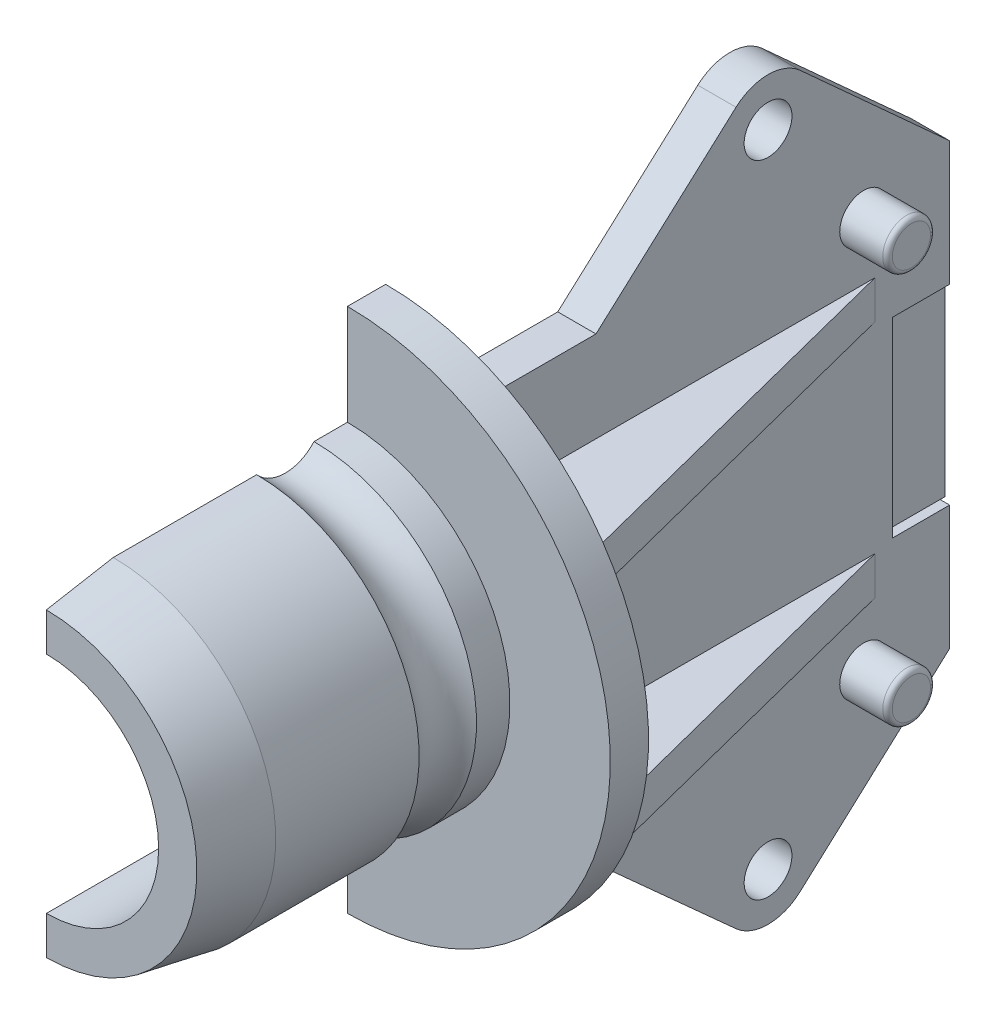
ISO-10303-21;
HEADER;
FILE_DESCRIPTION(('STEP AP214'),'2;1');
FILE_NAME('part.step','',(''),(''),'','','');
FILE_SCHEMA(('AUTOMOTIVE_DESIGN { 1 0 10303 214 1 1 1 1 }'));
ENDSEC;
DATA;
#1=APPLICATION_CONTEXT('core data for automotive mechanical design processes');
#2=APPLICATION_PROTOCOL_DEFINITION('international standard','automotive_design',2000,#1);
#3=PRODUCT_CONTEXT('',#1,'mechanical');
#4=PRODUCT('Part','Part','',(#3));
#5=PRODUCT_RELATED_PRODUCT_CATEGORY('part','',(#4));
#6=PRODUCT_DEFINITION_FORMATION('','',#4);
#7=PRODUCT_DEFINITION_CONTEXT('part definition',#1,'design');
#8=PRODUCT_DEFINITION('design','',#6,#7);
#9=PRODUCT_DEFINITION_SHAPE('','',#8);
#10=(LENGTH_UNIT() NAMED_UNIT(*) SI_UNIT(.MILLI.,.METRE.));
#11=(NAMED_UNIT(*) PLANE_ANGLE_UNIT() SI_UNIT($,.RADIAN.));
#12=(NAMED_UNIT(*) SI_UNIT($,.STERADIAN.) SOLID_ANGLE_UNIT());
#13=UNCERTAINTY_MEASURE_WITH_UNIT(LENGTH_MEASURE(1.E-05),#10,'distance_accuracy_value','');
#14=(GEOMETRIC_REPRESENTATION_CONTEXT(3) GLOBAL_UNCERTAINTY_ASSIGNED_CONTEXT((#13)) GLOBAL_UNIT_ASSIGNED_CONTEXT((#10,
#11,#12)) REPRESENTATION_CONTEXT('',''));
#15=CARTESIAN_POINT('',(0.,0.,0.));
#16=DIRECTION('',(0.,0.,1.));
#17=DIRECTION('',(1.,0.,0.));
#18=AXIS2_PLACEMENT_3D('',#15,#16,#17);
#19=CARTESIAN_POINT('',(24.,-67.,-127.));
#20=DIRECTION('',(1.,0.,0.));
#21=DIRECTION('',(0.,0.,-1.));
#22=AXIS2_PLACEMENT_3D('',#19,#20,#21);
#23=PLANE('',#22);
#24=CARTESIAN_POINT('',(24.,-41.,-147.));
#25=DIRECTION('',(1.,0.,0.));
#26=DIRECTION('',(0.,0.,-1.));
#27=AXIS2_PLACEMENT_3D('',#24,#25,#26);
#28=CIRCLE('',#27,5.00000000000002);
#29=CARTESIAN_POINT('',(24.,-41.,-152.));
#30=VERTEX_POINT('',#29);
#31=EDGE_CURVE('E586',#30,#30,#28,.T.);
#32=ORIENTED_EDGE('',*,*,#31,.F.);
#33=EDGE_LOOP('',(#32));
#34=FACE_BOUND('',#33,.T.);
#35=CARTESIAN_POINT('',(24.,67.,-127.));
#36=DIRECTION('',(1.,0.,0.));
#37=DIRECTION('',(0.,0.,-1.));
#38=AXIS2_PLACEMENT_3D('',#35,#36,#37);
#39=CIRCLE('',#38,5.00000000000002);
#40=CARTESIAN_POINT('',(24.,67.,-132.));
#41=VERTEX_POINT('',#40);
#42=EDGE_CURVE('E574',#41,#41,#39,.T.);
#43=ORIENTED_EDGE('',*,*,#42,.F.);
#44=EDGE_LOOP('',(#43));
#45=FACE_BOUND('',#44,.T.);
#46=CARTESIAN_POINT('',(24.,-67.,-127.));
#47=DIRECTION('',(1.,0.,0.));
#48=DIRECTION('',(0.,0.,1.));
#49=AXIS2_PLACEMENT_3D('',#46,#47,#48);
#50=CIRCLE('',#49,5.00000000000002);
#51=CARTESIAN_POINT('',(24.,-67.,-122.));
#52=VERTEX_POINT('',#51);
#53=EDGE_CURVE('E580',#52,#52,#50,.T.);
#54=ORIENTED_EDGE('',*,*,#53,.F.);
#55=EDGE_LOOP('',(#54));
#56=FACE_BOUND('',#55,.T.);
#57=DIRECTION('',(0.,0.,-1.));
#58=VECTOR('',#57,1.);
#59=CARTESIAN_POINT('',(24.,-20.,-153.));
#60=LINE('',#59,#58);
#61=CARTESIAN_POINT('',(24.,-20.,-153.));
#62=VERTEX_POINT('',#61);
#63=CARTESIAN_POINT('',(24.,-20.,-165.));
#64=VERTEX_POINT('',#63);
#65=EDGE_CURVE('E645',#62,#64,#60,.T.);
#66=ORIENTED_EDGE('',*,*,#65,.F.);
#67=DIRECTION('',(0.,-1.,0.));
#68=VECTOR('',#67,1.);
#69=CARTESIAN_POINT('',(24.,-20.,-153.));
#70=LINE('',#69,#68);
#71=CARTESIAN_POINT('',(24.,20.,-153.));
#72=VERTEX_POINT('',#71);
#73=EDGE_CURVE('E650',#72,#62,#70,.T.);
#74=ORIENTED_EDGE('',*,*,#73,.F.);
#75=DIRECTION('',(0.,0.,-1.));
#76=VECTOR('',#75,1.);
#77=CARTESIAN_POINT('',(24.,20.,-153.));
#78=LINE('',#77,#76);
#79=CARTESIAN_POINT('',(24.,20.,-165.));
#80=VERTEX_POINT('',#79);
#81=EDGE_CURVE('E642',#72,#80,#78,.T.);
#82=ORIENTED_EDGE('',*,*,#81,.T.);
#83=DIRECTION('',(0.,1.,0.));
#84=VECTOR('',#83,1.);
#85=CARTESIAN_POINT('',(24.,-46.,-165.));
#86=LINE('',#85,#84);
#87=CARTESIAN_POINT('',(24.,46.,-165.));
#88=VERTEX_POINT('',#87);
#89=EDGE_CURVE('E536',#80,#88,#86,.T.);
#90=ORIENTED_EDGE('',*,*,#89,.T.);
#91=DIRECTION('',(0.,0.672272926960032,0.740303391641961));
#92=VECTOR('',#91,1.);
#93=CARTESIAN_POINT('',(24.,74.4030339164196,-133.7227292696));
#94=LINE('',#93,#92);
#95=CARTESIAN_POINT('',(24.,74.4030339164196,-133.7227292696));
#96=VERTEX_POINT('',#95);
#97=EDGE_CURVE('E531',#88,#96,#94,.T.);
#98=ORIENTED_EDGE('',*,*,#97,.T.);
#99=CARTESIAN_POINT('',(24.,67.,-127.));
#100=DIRECTION('',(1.,0.,0.));
#101=DIRECTION('',(0.,0.,1.));
#102=AXIS2_PLACEMENT_3D('',#99,#100,#101);
#103=CIRCLE('',#102,10.);
#104=CARTESIAN_POINT('',(24.,74.426181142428,-120.302848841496));
#105=VERTEX_POINT('',#104);
#106=EDGE_CURVE('E529',#96,#105,#103,.T.);
#107=ORIENTED_EDGE('',*,*,#106,.T.);
#108=DIRECTION('',(0.,-0.669715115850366,0.742618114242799));
#109=VECTOR('',#108,1.);
#110=CARTESIAN_POINT('',(24.,48.,-91.));
#111=LINE('',#110,#109);
#112=CARTESIAN_POINT('',(24.,48.,-91.));
#113=VERTEX_POINT('',#112);
#114=EDGE_CURVE('E527',#105,#113,#111,.T.);
#115=ORIENTED_EDGE('',*,*,#114,.T.);
#116=DIRECTION('',(0.,0.,1.));
#117=VECTOR('',#116,1.);
#118=CARTESIAN_POINT('',(24.,48.,-71.));
#119=LINE('',#118,#117);
#120=CARTESIAN_POINT('',(24.,48.,-71.));
#121=VERTEX_POINT('',#120);
#122=EDGE_CURVE('E524',#113,#121,#119,.T.);
#123=ORIENTED_EDGE('',*,*,#122,.T.);
#124=DIRECTION('',(0.,-1.,0.));
#125=VECTOR('',#124,1.);
#126=CARTESIAN_POINT('',(24.,48.,-71.));
#127=LINE('',#126,#125);
#128=CARTESIAN_POINT('',(24.,29.,-71.));
#129=VERTEX_POINT('',#128);
#130=EDGE_CURVE('E545',#121,#129,#127,.T.);
#131=ORIENTED_EDGE('',*,*,#130,.T.);
#132=DIRECTION('',(0.,0.,1.));
#133=VECTOR('',#132,1.);
#134=CARTESIAN_POINT('',(24.,29.,-71.));
#135=LINE('',#134,#133);
#136=CARTESIAN_POINT('',(24.,29.,-149.3613646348));
#137=VERTEX_POINT('',#136);
#138=EDGE_CURVE('E594',#137,#129,#135,.T.);
#139=ORIENTED_EDGE('',*,*,#138,.F.);
#140=DIRECTION('',(0.,-1.,0.));
#141=VECTOR('',#140,1.);
#142=CARTESIAN_POINT('',(24.,29.,-149.3613646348));
#143=LINE('',#142,#141);
#144=CARTESIAN_POINT('',(24.,21.,-149.3613646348));
#145=VERTEX_POINT('',#144);
#146=EDGE_CURVE('E592',#137,#145,#143,.T.);
#147=ORIENTED_EDGE('',*,*,#146,.T.);
#148=DIRECTION('',(0.,0.,1.));
#149=VECTOR('',#148,1.);
#150=CARTESIAN_POINT('',(24.,21.,-71.));
#151=LINE('',#150,#149);
#152=CARTESIAN_POINT('',(24.,21.,-71.));
#153=VERTEX_POINT('',#152);
#154=EDGE_CURVE('E603',#145,#153,#151,.T.);
#155=ORIENTED_EDGE('',*,*,#154,.T.);
#156=CARTESIAN_POINT('',(24.,-21.,-71.));
#157=VERTEX_POINT('',#156);
#158=EDGE_CURVE('E548',#153,#157,#127,.T.);
#159=ORIENTED_EDGE('',*,*,#158,.T.);
#160=DIRECTION('',(0.,0.,1.));
#161=VECTOR('',#160,1.);
#162=CARTESIAN_POINT('',(24.,-21.,-71.));
#163=LINE('',#162,#161);
#164=CARTESIAN_POINT('',(24.,-21.,-149.3613646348));
#165=VERTEX_POINT('',#164);
#166=EDGE_CURVE('E625',#165,#157,#163,.T.);
#167=ORIENTED_EDGE('',*,*,#166,.F.);
#168=DIRECTION('',(0.,1.,0.));
#169=VECTOR('',#168,1.);
#170=CARTESIAN_POINT('',(24.,-29.,-149.3613646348));
#171=LINE('',#170,#169);
#172=CARTESIAN_POINT('',(24.,-29.,-149.3613646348));
#173=VERTEX_POINT('',#172);
#174=EDGE_CURVE('E610',#173,#165,#171,.T.);
#175=ORIENTED_EDGE('',*,*,#174,.F.);
#176=DIRECTION('',(0.,0.,1.));
#177=VECTOR('',#176,1.);
#178=CARTESIAN_POINT('',(24.,-29.,-71.));
#179=LINE('',#178,#177);
#180=CARTESIAN_POINT('',(24.,-29.,-71.));
#181=VERTEX_POINT('',#180);
#182=EDGE_CURVE('E618',#173,#181,#179,.T.);
#183=ORIENTED_EDGE('',*,*,#182,.T.);
#184=CARTESIAN_POINT('',(24.,-48.,-71.));
#185=VERTEX_POINT('',#184);
#186=EDGE_CURVE('E549',#181,#185,#127,.T.);
#187=ORIENTED_EDGE('',*,*,#186,.T.);
#188=DIRECTION('',(0.,0.,-1.));
#189=VECTOR('',#188,1.);
#190=CARTESIAN_POINT('',(24.,-48.,-71.));
#191=LINE('',#190,#189);
#192=CARTESIAN_POINT('',(24.,-48.,-91.));
#193=VERTEX_POINT('',#192);
#194=EDGE_CURVE('E543',#185,#193,#191,.T.);
#195=ORIENTED_EDGE('',*,*,#194,.T.);
#196=DIRECTION('',(0.,-0.669715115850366,-0.742618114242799));
#197=VECTOR('',#196,1.);
#198=CARTESIAN_POINT('',(24.,-48.,-91.));
#199=LINE('',#198,#197);
#200=CARTESIAN_POINT('',(24.,-74.426181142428,-120.302848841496));
#201=VERTEX_POINT('',#200);
#202=EDGE_CURVE('E541',#193,#201,#199,.T.);
#203=ORIENTED_EDGE('',*,*,#202,.T.);
#204=CARTESIAN_POINT('',(24.,-67.,-127.));
#205=DIRECTION('',(1.,0.,0.));
#206=DIRECTION('',(0.,0.,-1.));
#207=AXIS2_PLACEMENT_3D('',#204,#205,#206);
#208=CIRCLE('',#207,10.);
#209=CARTESIAN_POINT('',(24.,-74.4030339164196,-133.7227292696));
#210=VERTEX_POINT('',#209);
#211=EDGE_CURVE('E539',#201,#210,#208,.T.);
#212=ORIENTED_EDGE('',*,*,#211,.T.);
#213=DIRECTION('',(0.,0.672272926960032,-0.740303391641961));
#214=VECTOR('',#213,1.);
#215=CARTESIAN_POINT('',(24.,-74.4030339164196,-133.7227292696));
#216=LINE('',#215,#214);
#217=CARTESIAN_POINT('',(24.,-46.,-165.));
#218=VERTEX_POINT('',#217);
#219=EDGE_CURVE('E537',#210,#218,#216,.T.);
#220=ORIENTED_EDGE('',*,*,#219,.T.);
#221=EDGE_CURVE('E533',#218,#64,#86,.T.);
#222=ORIENTED_EDGE('',*,*,#221,.T.);
#223=EDGE_LOOP('',(#66,#74,#82,#90,#98,#107,#115,#123,#131,#139,#147,#155,#159,#167,#175,#183,
#187,#195,#203,#212,#220,#222));
#224=FACE_BOUND('',#223,.T.);
#225=CARTESIAN_POINT('',(24.,41.,-147.));
#226=DIRECTION('',(1.,0.,0.));
#227=DIRECTION('',(0.,0.,-1.));
#228=AXIS2_PLACEMENT_3D('',#225,#226,#227);
#229=CIRCLE('',#228,5.00000000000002);
#230=CARTESIAN_POINT('',(24.,41.,-152.));
#231=VERTEX_POINT('',#230);
#232=EDGE_CURVE('E313',#231,#231,#229,.F.);
#233=ORIENTED_EDGE('',*,*,#232,.T.);
#234=EDGE_LOOP('',(#233));
#235=FACE_BOUND('',#234,.T.);
#236=ADVANCED_FACE('F35',(#34,#45,#56,#224,#235),#23,.T.);
#237=CARTESIAN_POINT('',(0.,93.,313.849585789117));
#238=DIRECTION('',(1.,0.,0.));
#239=DIRECTION('',(0.,0.,-1.));
#240=AXIS2_PLACEMENT_3D('',#237,#238,#239);
#241=PLANE('',#240);
#242=DIRECTION('',(0.,-0.175790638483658,0.984427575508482));
#243=VECTOR('',#242,1.);
#244=CARTESIAN_POINT('',(0.,0.,176.4));
#245=LINE('',#244,#243);
#246=CARTESIAN_POINT('',(0.,34.,-14.));
#247=VERTEX_POINT('',#246);
#248=CARTESIAN_POINT('',(0.,31.5,0.));
#249=VERTEX_POINT('',#248);
#250=EDGE_CURVE('E457',#247,#249,#245,.T.);
#251=ORIENTED_EDGE('',*,*,#250,.F.);
#252=DIRECTION('',(0.,0.,1.));
#253=VECTOR('',#252,1.);
#254=CARTESIAN_POINT('',(0.,34.,54.));
#255=LINE('',#254,#253);
#256=CARTESIAN_POINT('',(0.,34.,-44.));
#257=VERTEX_POINT('',#256);
#258=EDGE_CURVE('E678',#257,#247,#255,.T.);
#259=ORIENTED_EDGE('',*,*,#258,.F.);
#260=CARTESIAN_POINT('',(0.,39.2915026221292,-50.));
#261=DIRECTION('',(1.,0.,0.));
#262=DIRECTION('',(0.,0.,-1.));
#263=AXIS2_PLACEMENT_3D('',#260,#261,#262);
#264=CIRCLE('',#263,8.);
#265=CARTESIAN_POINT('',(0.,34.,-56.));
#266=VERTEX_POINT('',#265);
#267=EDGE_CURVE('E681',#266,#257,#264,.F.);
#268=ORIENTED_EDGE('',*,*,#267,.F.);
#269=DIRECTION('',(0.,0.,1.));
#270=VECTOR('',#269,1.);
#271=CARTESIAN_POINT('',(0.,34.,54.));
#272=LINE('',#271,#270);
#273=CARTESIAN_POINT('',(0.,34.,-63.));
#274=VERTEX_POINT('',#273);
#275=EDGE_CURVE('E684',#274,#266,#272,.T.);
#276=ORIENTED_EDGE('',*,*,#275,.F.);
#277=DIRECTION('',(0.,-1.,0.));
#278=VECTOR('',#277,1.);
#279=CARTESIAN_POINT('',(0.,55.,-63.));
#280=LINE('',#279,#278);
#281=CARTESIAN_POINT('',(0.,55.,-63.));
#282=VERTEX_POINT('',#281);
#283=EDGE_CURVE('E687',#282,#274,#280,.T.);
#284=ORIENTED_EDGE('',*,*,#283,.F.);
#285=DIRECTION('',(0.,0.,1.));
#286=VECTOR('',#285,1.);
#287=CARTESIAN_POINT('',(0.,55.,54.));
#288=LINE('',#287,#286);
#289=CARTESIAN_POINT('',(0.,55.,-71.));
#290=VERTEX_POINT('',#289);
#291=EDGE_CURVE('E688',#290,#282,#288,.T.);
#292=ORIENTED_EDGE('',*,*,#291,.F.);
#293=DIRECTION('',(0.,1.,0.));
#294=VECTOR('',#293,1.);
#295=CARTESIAN_POINT('',(0.,15.,-71.));
#296=LINE('',#295,#294);
#297=CARTESIAN_POINT('',(0.,15.,-71.));
#298=VERTEX_POINT('',#297);
#299=EDGE_CURVE('E691',#298,#290,#296,.T.);
#300=ORIENTED_EDGE('',*,*,#299,.F.);
#301=DIRECTION('',(0.,0.,1.));
#302=VECTOR('',#301,1.);
#303=CARTESIAN_POINT('',(0.,15.,54.));
#304=LINE('',#303,#302);
#305=CARTESIAN_POINT('',(0.,15.,-63.));
#306=VERTEX_POINT('',#305);
#307=EDGE_CURVE('E692',#306,#298,#304,.F.);
#308=ORIENTED_EDGE('',*,*,#307,.F.);
#309=DIRECTION('',(0.,-1.,0.));
#310=VECTOR('',#309,1.);
#311=CARTESIAN_POINT('',(0.,22.,-63.));
#312=LINE('',#311,#310);
#313=CARTESIAN_POINT('',(0.,22.,-63.));
#314=VERTEX_POINT('',#313);
#315=EDGE_CURVE('E696',#314,#306,#312,.T.);
#316=ORIENTED_EDGE('',*,*,#315,.F.);
#317=DIRECTION('',(0.,0.,1.));
#318=VECTOR('',#317,1.);
#319=CARTESIAN_POINT('',(0.,22.,54.));
#320=LINE('',#319,#318);
#321=CARTESIAN_POINT('',(0.,22.,-46.));
#322=VERTEX_POINT('',#321);
#323=EDGE_CURVE('E697',#322,#314,#320,.F.);
#324=ORIENTED_EDGE('',*,*,#323,.F.);
#325=DIRECTION('',(0.,-1.,0.));
#326=VECTOR('',#325,1.);
#327=CARTESIAN_POINT('',(0.,23.5,-46.));
#328=LINE('',#327,#326);
#329=CARTESIAN_POINT('',(0.,23.5,-46.));
#330=VERTEX_POINT('',#329);
#331=EDGE_CURVE('E58',#330,#322,#328,.T.);
#332=ORIENTED_EDGE('',*,*,#331,.F.);
#333=DIRECTION('',(0.,0.,1.));
#334=VECTOR('',#333,1.);
#335=CARTESIAN_POINT('',(0.,23.5,54.));
#336=LINE('',#335,#334);
#337=CARTESIAN_POINT('',(0.,23.5,0.));
#338=VERTEX_POINT('',#337);
#339=EDGE_CURVE('E700',#338,#330,#336,.F.);
#340=ORIENTED_EDGE('',*,*,#339,.F.);
#341=DIRECTION('',(0.,-1.,0.));
#342=VECTOR('',#341,1.);
#343=CARTESIAN_POINT('',(0.,31.5,0.));
#344=LINE('',#343,#342);
#345=EDGE_CURVE('E695',#249,#338,#344,.T.);
#346=ORIENTED_EDGE('',*,*,#345,.F.);
#347=EDGE_LOOP('',(#251,#259,#268,#276,#284,#292,#300,#308,#316,#324,#332,#340,#346));
#348=FACE_BOUND('',#347,.T.);
#349=ADVANCED_FACE('F347',(#348),#241,.F.);
#350=CARTESIAN_POINT('',(-24.,20.,-153.));
#351=DIRECTION('',(0.,0.,-1.));
#352=DIRECTION('',(-1.,0.,0.));
#353=AXIS2_PLACEMENT_3D('',#350,#351,#352);
#354=PLANE('',#353);
#355=DIRECTION('',(0.,1.,0.));
#356=VECTOR('',#355,1.);
#357=CARTESIAN_POINT('',(16.,-67.,-153.));
#358=LINE('',#357,#356);
#359=CARTESIAN_POINT('',(16.,-20.,-153.));
#360=VERTEX_POINT('',#359);
#361=CARTESIAN_POINT('',(16.,-19.,-153.));
#362=VERTEX_POINT('',#361);
#363=EDGE_CURVE('E637',#360,#362,#358,.T.);
#364=ORIENTED_EDGE('',*,*,#363,.T.);
#365=DIRECTION('',(-1.,0.,0.));
#366=VECTOR('',#365,1.);
#367=CARTESIAN_POINT('',(23.,-19.,-153.));
#368=LINE('',#367,#366);
#369=CARTESIAN_POINT('',(23.,-19.,-153.));
#370=VERTEX_POINT('',#369);
#371=EDGE_CURVE('E670',#370,#362,#368,.T.);
#372=ORIENTED_EDGE('',*,*,#371,.F.);
#373=DIRECTION('',(0.,-1.,0.));
#374=VECTOR('',#373,1.);
#375=CARTESIAN_POINT('',(23.,19.,-153.));
#376=LINE('',#375,#374);
#377=CARTESIAN_POINT('',(23.,19.,-153.));
#378=VERTEX_POINT('',#377);
#379=EDGE_CURVE('E301',#378,#370,#376,.T.);
#380=ORIENTED_EDGE('',*,*,#379,.F.);
#381=DIRECTION('',(-1.,0.,0.));
#382=VECTOR('',#381,1.);
#383=CARTESIAN_POINT('',(-24.,19.,-153.));
#384=LINE('',#383,#382);
#385=CARTESIAN_POINT('',(16.,19.,-153.));
#386=VERTEX_POINT('',#385);
#387=EDGE_CURVE('E318',#378,#386,#384,.T.);
#388=ORIENTED_EDGE('',*,*,#387,.T.);
#389=CARTESIAN_POINT('',(16.,20.,-153.));
#390=VERTEX_POINT('',#389);
#391=EDGE_CURVE('E641',#386,#390,#358,.T.);
#392=ORIENTED_EDGE('',*,*,#391,.T.);
#393=DIRECTION('',(1.,0.,0.));
#394=VECTOR('',#393,1.);
#395=CARTESIAN_POINT('',(-24.,20.,-153.));
#396=LINE('',#395,#394);
#397=EDGE_CURVE('E652',#390,#72,#396,.T.);
#398=ORIENTED_EDGE('',*,*,#397,.T.);
#399=ORIENTED_EDGE('',*,*,#73,.T.);
#400=DIRECTION('',(-1.,0.,0.));
#401=VECTOR('',#400,1.);
#402=CARTESIAN_POINT('',(-24.,-20.,-153.));
#403=LINE('',#402,#401);
#404=EDGE_CURVE('E646',#62,#360,#403,.T.);
#405=ORIENTED_EDGE('',*,*,#404,.T.);
#406=EDGE_LOOP('',(#364,#372,#380,#388,#392,#398,#399,#405));
#407=FACE_BOUND('',#406,.T.);
#408=ADVANCED_FACE('F353',(#407),#354,.T.);
#409=CARTESIAN_POINT('',(24.,46.,-165.));
#410=DIRECTION('',(0.,0.,1.));
#411=DIRECTION('',(1.,0.,0.));
#412=AXIS2_PLACEMENT_3D('',#409,#410,#411);
#413=PLANE('',#412);
#414=DIRECTION('',(0.,1.,0.));
#415=VECTOR('',#414,1.);
#416=CARTESIAN_POINT('',(16.,46.,-165.));
#417=LINE('',#416,#415);
#418=CARTESIAN_POINT('',(16.,-46.,-165.));
#419=VERTEX_POINT('',#418);
#420=CARTESIAN_POINT('',(16.,-20.,-165.));
#421=VERTEX_POINT('',#420);
#422=EDGE_CURVE('E559',#419,#421,#417,.T.);
#423=ORIENTED_EDGE('',*,*,#422,.T.);
#424=DIRECTION('',(-1.,0.,0.));
#425=VECTOR('',#424,1.);
#426=CARTESIAN_POINT('',(-24.,-20.,-165.));
#427=LINE('',#426,#425);
#428=EDGE_CURVE('E654',#64,#421,#427,.T.);
#429=ORIENTED_EDGE('',*,*,#428,.F.);
#430=ORIENTED_EDGE('',*,*,#221,.F.);
#431=DIRECTION('',(-1.,0.,0.));
#432=VECTOR('',#431,1.);
#433=CARTESIAN_POINT('',(24.,-46.,-165.));
#434=LINE('',#433,#432);
#435=EDGE_CURVE('E507',#218,#419,#434,.T.);
#436=ORIENTED_EDGE('',*,*,#435,.T.);
#437=EDGE_LOOP('',(#423,#429,#430,#436));
#438=FACE_BOUND('',#437,.T.);
#439=ADVANCED_FACE('F384',(#438),#413,.F.);
#440=CARTESIAN_POINT('',(0.,15.,-71.));
#441=DIRECTION('',(0.,0.,1.));
#442=DIRECTION('',(1.,0.,0.));
#443=AXIS2_PLACEMENT_3D('',#440,#441,#442);
#444=PLANE('',#443);
#445=CARTESIAN_POINT('',(0.,0.,-71.));
#446=DIRECTION('',(0.,0.,1.));
#447=DIRECTION('',(1.,0.,0.));
#448=AXIS2_PLACEMENT_3D('',#445,#446,#447);
#449=CIRCLE('',#448,55.);
#450=CARTESIAN_POINT('',(0.,-55.,-71.));
#451=VERTEX_POINT('',#450);
#452=EDGE_CURVE('E474',#451,#290,#449,.T.);
#453=ORIENTED_EDGE('',*,*,#452,.F.);
#454=CARTESIAN_POINT('',(0.,-15.,-71.));
#455=VERTEX_POINT('',#454);
#456=EDGE_CURVE('E718',#451,#455,#296,.T.);
#457=ORIENTED_EDGE('',*,*,#456,.T.);
#458=CARTESIAN_POINT('',(0.,0.,-71.));
#459=DIRECTION('',(0.,0.,1.));
#460=DIRECTION('',(1.,0.,0.));
#461=AXIS2_PLACEMENT_3D('',#458,#459,#460);
#462=CIRCLE('',#461,15.);
#463=EDGE_CURVE('E477',#455,#298,#462,.T.);
#464=ORIENTED_EDGE('',*,*,#463,.T.);
#465=ORIENTED_EDGE('',*,*,#299,.T.);
#466=EDGE_LOOP('',(#453,#457,#464,#465));
#467=FACE_BOUND('',#466,.T.);
#468=DIRECTION('',(1.,0.,0.));
#469=VECTOR('',#468,1.);
#470=CARTESIAN_POINT('',(44.,-29.,-71.));
#471=LINE('',#470,#469);
#472=CARTESIAN_POINT('',(44.,-29.,-71.));
#473=VERTEX_POINT('',#472);
#474=EDGE_CURVE('E620',#181,#473,#471,.T.);
#475=ORIENTED_EDGE('',*,*,#474,.T.);
#476=DIRECTION('',(0.,1.,0.));
#477=VECTOR('',#476,1.);
#478=CARTESIAN_POINT('',(44.,-29.,-71.));
#479=LINE('',#478,#477);
#480=CARTESIAN_POINT('',(44.,-21.,-71.));
#481=VERTEX_POINT('',#480);
#482=EDGE_CURVE('E613',#473,#481,#479,.T.);
#483=ORIENTED_EDGE('',*,*,#482,.T.);
#484=DIRECTION('',(1.,0.,0.));
#485=VECTOR('',#484,1.);
#486=CARTESIAN_POINT('',(44.,-21.,-71.));
#487=LINE('',#486,#485);
#488=EDGE_CURVE('E628',#157,#481,#487,.T.);
#489=ORIENTED_EDGE('',*,*,#488,.F.);
#490=ORIENTED_EDGE('',*,*,#158,.F.);
#491=DIRECTION('',(1.,0.,0.));
#492=VECTOR('',#491,1.);
#493=CARTESIAN_POINT('',(44.,21.,-71.));
#494=LINE('',#493,#492);
#495=CARTESIAN_POINT('',(44.,21.,-71.));
#496=VERTEX_POINT('',#495);
#497=EDGE_CURVE('E608',#153,#496,#494,.T.);
#498=ORIENTED_EDGE('',*,*,#497,.T.);
#499=DIRECTION('',(0.,-1.,0.));
#500=VECTOR('',#499,1.);
#501=CARTESIAN_POINT('',(44.,29.,-71.));
#502=LINE('',#501,#500);
#503=CARTESIAN_POINT('',(44.,29.,-71.));
#504=VERTEX_POINT('',#503);
#505=EDGE_CURVE('E589',#504,#496,#502,.T.);
#506=ORIENTED_EDGE('',*,*,#505,.F.);
#507=DIRECTION('',(1.,0.,0.));
#508=VECTOR('',#507,1.);
#509=CARTESIAN_POINT('',(44.,29.,-71.));
#510=LINE('',#509,#508);
#511=EDGE_CURVE('E600',#129,#504,#510,.T.);
#512=ORIENTED_EDGE('',*,*,#511,.F.);
#513=ORIENTED_EDGE('',*,*,#130,.F.);
#514=DIRECTION('',(-1.,0.,0.));
#515=VECTOR('',#514,1.);
#516=CARTESIAN_POINT('',(24.,48.,-71.));
#517=LINE('',#516,#515);
#518=CARTESIAN_POINT('',(16.,48.,-71.));
#519=VERTEX_POINT('',#518);
#520=EDGE_CURVE('E522',#121,#519,#517,.T.);
#521=ORIENTED_EDGE('',*,*,#520,.T.);
#522=DIRECTION('',(0.,-1.,0.));
#523=VECTOR('',#522,1.);
#524=CARTESIAN_POINT('',(16.,48.,-71.));
#525=LINE('',#524,#523);
#526=CARTESIAN_POINT('',(16.,-48.,-71.));
#527=VERTEX_POINT('',#526);
#528=EDGE_CURVE('E572',#519,#527,#525,.T.);
#529=ORIENTED_EDGE('',*,*,#528,.T.);
#530=DIRECTION('',(-1.,0.,0.));
#531=VECTOR('',#530,1.);
#532=CARTESIAN_POINT('',(24.,-48.,-71.));
#533=LINE('',#532,#531);
#534=EDGE_CURVE('E495',#185,#527,#533,.T.);
#535=ORIENTED_EDGE('',*,*,#534,.F.);
#536=ORIENTED_EDGE('',*,*,#186,.F.);
#537=EDGE_LOOP('',(#475,#483,#489,#490,#498,#506,#512,#513,#521,#529,#535,#536));
#538=FACE_BOUND('',#537,.T.);
#539=ADVANCED_FACE('F421',(#467,#538),#444,.F.);
#540=CARTESIAN_POINT('',(0.,31.5,0.));
#541=DIRECTION('',(0.,0.,-1.));
#542=DIRECTION('',(-1.,0.,0.));
#543=AXIS2_PLACEMENT_3D('',#540,#541,#542);
#544=PLANE('',#543);
#545=CARTESIAN_POINT('',(0.,0.,0.));
#546=DIRECTION('',(0.,0.,1.));
#547=DIRECTION('',(1.,0.,0.));
#548=AXIS2_PLACEMENT_3D('',#545,#546,#547);
#549=CIRCLE('',#548,31.5);
#550=CARTESIAN_POINT('',(0.,-31.5,0.));
#551=VERTEX_POINT('',#550);
#552=EDGE_CURVE('E323',#551,#249,#549,.T.);
#553=ORIENTED_EDGE('',*,*,#552,.T.);
#554=ORIENTED_EDGE('',*,*,#345,.T.);
#555=CARTESIAN_POINT('',(0.,0.,0.));
#556=DIRECTION('',(0.,0.,1.));
#557=DIRECTION('',(1.,0.,0.));
#558=AXIS2_PLACEMENT_3D('',#555,#556,#557);
#559=CIRCLE('',#558,23.5);
#560=CARTESIAN_POINT('',(0.,-23.5,0.));
#561=VERTEX_POINT('',#560);
#562=EDGE_CURVE('E492',#561,#338,#559,.T.);
#563=ORIENTED_EDGE('',*,*,#562,.F.);
#564=EDGE_CURVE('E50',#561,#551,#344,.T.);
#565=ORIENTED_EDGE('',*,*,#564,.T.);
#566=EDGE_LOOP('',(#553,#554,#563,#565));
#567=FACE_BOUND('',#566,.T.);
#568=ADVANCED_FACE('F37',(#567),#544,.F.);
#569=CARTESIAN_POINT('',(0.,0.,-14.));
#570=DIRECTION('',(0.,0.,-1.));
#571=DIRECTION('',(-1.,0.,0.));
#572=AXIS2_PLACEMENT_3D('',#569,#570,#571);
#573=CONICAL_SURFACE('',#572,34.,0.176708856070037);
#574=ORIENTED_EDGE('',*,*,#552,.F.);
#575=DIRECTION('',(0.,-0.175790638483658,-0.984427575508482));
#576=VECTOR('',#575,1.);
#577=CARTESIAN_POINT('',(0.,0.,176.4));
#578=LINE('',#577,#576);
#579=CARTESIAN_POINT('',(0.,-34.,-14.));
#580=VERTEX_POINT('',#579);
#581=EDGE_CURVE('E455',#551,#580,#578,.T.);
#582=ORIENTED_EDGE('',*,*,#581,.T.);
#583=CARTESIAN_POINT('',(0.,0.,-14.));
#584=DIRECTION('',(0.,0.,1.));
#585=DIRECTION('',(1.,0.,0.));
#586=AXIS2_PLACEMENT_3D('',#583,#584,#585);
#587=CIRCLE('',#586,34.);
#588=EDGE_CURVE('E459',#580,#247,#587,.T.);
#589=ORIENTED_EDGE('',*,*,#588,.T.);
#590=ORIENTED_EDGE('',*,*,#250,.T.);
#591=EDGE_LOOP('',(#574,#582,#589,#590));
#592=FACE_BOUND('',#591,.T.);
#593=ADVANCED_FACE('F442',(#592),#573,.T.);
#594=CARTESIAN_POINT('',(0.,0.,54.));
#595=DIRECTION('',(0.,0.,1.));
#596=DIRECTION('',(1.,0.,0.));
#597=AXIS2_PLACEMENT_3D('',#594,#595,#596);
#598=CYLINDRICAL_SURFACE('',#597,34.);
#599=CARTESIAN_POINT('',(0.,0.,-44.));
#600=DIRECTION('',(0.,0.,1.));
#601=DIRECTION('',(1.,0.,0.));
#602=AXIS2_PLACEMENT_3D('',#599,#600,#601);
#603=CIRCLE('',#602,34.);
#604=CARTESIAN_POINT('',(0.,-34.,-44.));
#605=VERTEX_POINT('',#604);
#606=EDGE_CURVE('E460',#605,#257,#603,.T.);
#607=ORIENTED_EDGE('',*,*,#606,.T.);
#608=ORIENTED_EDGE('',*,*,#258,.T.);
#609=ORIENTED_EDGE('',*,*,#588,.F.);
#610=DIRECTION('',(0.,0.,1.));
#611=VECTOR('',#610,1.);
#612=CARTESIAN_POINT('',(0.,-34.,54.));
#613=LINE('',#612,#611);
#614=EDGE_CURVE('E703',#580,#605,#613,.F.);
#615=ORIENTED_EDGE('',*,*,#614,.T.);
#616=EDGE_LOOP('',(#607,#608,#609,#615));
#617=FACE_BOUND('',#616,.T.);
#618=ADVANCED_FACE('F439',(#617),#598,.T.);
#619=CARTESIAN_POINT('',(0.,0.,-50.));
#620=DIRECTION('',(0.,0.,1.));
#621=DIRECTION('',(1.,0.,0.));
#622=AXIS2_PLACEMENT_3D('',#619,#620,#621);
#623=TOROIDAL_SURFACE('',#622,39.2915026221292,8.);
#624=CARTESIAN_POINT('',(0.,0.,-56.));
#625=DIRECTION('',(0.,0.,1.));
#626=DIRECTION('',(1.,0.,0.));
#627=AXIS2_PLACEMENT_3D('',#624,#625,#626);
#628=CIRCLE('',#627,34.);
#629=CARTESIAN_POINT('',(0.,-34.,-56.));
#630=VERTEX_POINT('',#629);
#631=EDGE_CURVE('E465',#630,#266,#628,.T.);
#632=ORIENTED_EDGE('',*,*,#631,.T.);
#633=ORIENTED_EDGE('',*,*,#267,.T.);
#634=ORIENTED_EDGE('',*,*,#606,.F.);
#635=CARTESIAN_POINT('',(0.,-39.2915026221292,-50.));
#636=DIRECTION('',(1.,0.,0.));
#637=DIRECTION('',(0.,0.,-1.));
#638=AXIS2_PLACEMENT_3D('',#635,#636,#637);
#639=CIRCLE('',#638,8.);
#640=EDGE_CURVE('E706',#605,#630,#639,.F.);
#641=ORIENTED_EDGE('',*,*,#640,.T.);
#642=EDGE_LOOP('',(#632,#633,#634,#641));
#643=FACE_BOUND('',#642,.T.);
#644=ADVANCED_FACE('F435',(#643),#623,.F.);
#645=CARTESIAN_POINT('',(0.,0.,54.));
#646=DIRECTION('',(0.,0.,1.));
#647=DIRECTION('',(1.,0.,0.));
#648=AXIS2_PLACEMENT_3D('',#645,#646,#647);
#649=CYLINDRICAL_SURFACE('',#648,34.);
#650=CARTESIAN_POINT('',(0.,0.,-63.));
#651=DIRECTION('',(0.,0.,1.));
#652=DIRECTION('',(1.,0.,0.));
#653=AXIS2_PLACEMENT_3D('',#650,#651,#652);
#654=CIRCLE('',#653,34.);
#655=CARTESIAN_POINT('',(0.,-34.,-63.));
#656=VERTEX_POINT('',#655);
#657=EDGE_CURVE('E468',#656,#274,#654,.T.);
#658=ORIENTED_EDGE('',*,*,#657,.T.);
#659=ORIENTED_EDGE('',*,*,#275,.T.);
#660=ORIENTED_EDGE('',*,*,#631,.F.);
#661=DIRECTION('',(0.,0.,1.));
#662=VECTOR('',#661,1.);
#663=CARTESIAN_POINT('',(0.,-34.,54.));
#664=LINE('',#663,#662);
#665=EDGE_CURVE('E709',#630,#656,#664,.F.);
#666=ORIENTED_EDGE('',*,*,#665,.T.);
#667=EDGE_LOOP('',(#658,#659,#660,#666));
#668=FACE_BOUND('',#667,.T.);
#669=ADVANCED_FACE('F431',(#668),#649,.T.);
#670=CARTESIAN_POINT('',(0.,55.,-63.));
#671=DIRECTION('',(0.,0.,-1.));
#672=DIRECTION('',(-1.,0.,0.));
#673=AXIS2_PLACEMENT_3D('',#670,#671,#672);
#674=PLANE('',#673);
#675=CARTESIAN_POINT('',(0.,0.,-63.));
#676=DIRECTION('',(0.,0.,1.));
#677=DIRECTION('',(1.,0.,0.));
#678=AXIS2_PLACEMENT_3D('',#675,#676,#677);
#679=CIRCLE('',#678,55.);
#680=CARTESIAN_POINT('',(0.,-55.,-63.));
#681=VERTEX_POINT('',#680);
#682=EDGE_CURVE('E471',#681,#282,#679,.T.);
#683=ORIENTED_EDGE('',*,*,#682,.T.);
#684=ORIENTED_EDGE('',*,*,#283,.T.);
#685=ORIENTED_EDGE('',*,*,#657,.F.);
#686=EDGE_CURVE('E712',#656,#681,#280,.T.);
#687=ORIENTED_EDGE('',*,*,#686,.T.);
#688=EDGE_LOOP('',(#683,#684,#685,#687));
#689=FACE_BOUND('',#688,.T.);
#690=ADVANCED_FACE('F427',(#689),#674,.F.);
#691=CARTESIAN_POINT('',(0.,0.,54.));
#692=DIRECTION('',(0.,0.,1.));
#693=DIRECTION('',(1.,0.,0.));
#694=AXIS2_PLACEMENT_3D('',#691,#692,#693);
#695=CYLINDRICAL_SURFACE('',#694,55.);
#696=ORIENTED_EDGE('',*,*,#452,.T.);
#697=ORIENTED_EDGE('',*,*,#291,.T.);
#698=ORIENTED_EDGE('',*,*,#682,.F.);
#699=DIRECTION('',(0.,0.,1.));
#700=VECTOR('',#699,1.);
#701=CARTESIAN_POINT('',(0.,-55.,54.));
#702=LINE('',#701,#700);
#703=EDGE_CURVE('E715',#681,#451,#702,.F.);
#704=ORIENTED_EDGE('',*,*,#703,.T.);
#705=EDGE_LOOP('',(#696,#697,#698,#704));
#706=FACE_BOUND('',#705,.T.);
#707=ADVANCED_FACE('F419',(#706),#695,.T.);
#708=CARTESIAN_POINT('',(0.,0.,54.));
#709=DIRECTION('',(0.,0.,1.));
#710=DIRECTION('',(1.,0.,0.));
#711=AXIS2_PLACEMENT_3D('',#708,#709,#710);
#712=CYLINDRICAL_SURFACE('',#711,15.);
#713=CARTESIAN_POINT('',(0.,0.,-63.));
#714=DIRECTION('',(0.,0.,1.));
#715=DIRECTION('',(1.,0.,0.));
#716=AXIS2_PLACEMENT_3D('',#713,#714,#715);
#717=CIRCLE('',#716,15.);
#718=CARTESIAN_POINT('',(0.,-15.,-63.));
#719=VERTEX_POINT('',#718);
#720=EDGE_CURVE('E480',#719,#306,#717,.T.);
#721=ORIENTED_EDGE('',*,*,#720,.T.);
#722=ORIENTED_EDGE('',*,*,#307,.T.);
#723=ORIENTED_EDGE('',*,*,#463,.F.);
#724=DIRECTION('',(0.,0.,1.));
#725=VECTOR('',#724,1.);
#726=CARTESIAN_POINT('',(0.,-15.,54.));
#727=LINE('',#726,#725);
#728=EDGE_CURVE('E722',#455,#719,#727,.T.);
#729=ORIENTED_EDGE('',*,*,#728,.T.);
#730=EDGE_LOOP('',(#721,#722,#723,#729));
#731=FACE_BOUND('',#730,.T.);
#732=ADVANCED_FACE('F415',(#731),#712,.F.);
#733=CARTESIAN_POINT('',(0.,22.,-63.));
#734=DIRECTION('',(0.,0.,-1.));
#735=DIRECTION('',(-1.,0.,0.));
#736=AXIS2_PLACEMENT_3D('',#733,#734,#735);
#737=PLANE('',#736);
#738=CARTESIAN_POINT('',(0.,0.,-63.));
#739=DIRECTION('',(0.,0.,1.));
#740=DIRECTION('',(1.,0.,0.));
#741=AXIS2_PLACEMENT_3D('',#738,#739,#740);
#742=CIRCLE('',#741,22.);
#743=CARTESIAN_POINT('',(0.,-22.,-63.));
#744=VERTEX_POINT('',#743);
#745=EDGE_CURVE('E483',#744,#314,#742,.T.);
#746=ORIENTED_EDGE('',*,*,#745,.T.);
#747=ORIENTED_EDGE('',*,*,#315,.T.);
#748=ORIENTED_EDGE('',*,*,#720,.F.);
#749=EDGE_CURVE('E725',#719,#744,#312,.T.);
#750=ORIENTED_EDGE('',*,*,#749,.T.);
#751=EDGE_LOOP('',(#746,#747,#748,#750));
#752=FACE_BOUND('',#751,.T.);
#753=ADVANCED_FACE('F411',(#752),#737,.F.);
#754=CARTESIAN_POINT('',(0.,0.,54.));
#755=DIRECTION('',(0.,0.,1.));
#756=DIRECTION('',(1.,0.,0.));
#757=AXIS2_PLACEMENT_3D('',#754,#755,#756);
#758=CYLINDRICAL_SURFACE('',#757,22.);
#759=CARTESIAN_POINT('',(0.,0.,-46.));
#760=DIRECTION('',(0.,0.,1.));
#761=DIRECTION('',(1.,0.,0.));
#762=AXIS2_PLACEMENT_3D('',#759,#760,#761);
#763=CIRCLE('',#762,22.);
#764=CARTESIAN_POINT('',(0.,-22.,-46.));
#765=VERTEX_POINT('',#764);
#766=EDGE_CURVE('E486',#765,#322,#763,.T.);
#767=ORIENTED_EDGE('',*,*,#766,.T.);
#768=ORIENTED_EDGE('',*,*,#323,.T.);
#769=ORIENTED_EDGE('',*,*,#745,.F.);
#770=DIRECTION('',(0.,0.,1.));
#771=VECTOR('',#770,1.);
#772=CARTESIAN_POINT('',(0.,-22.,54.));
#773=LINE('',#772,#771);
#774=EDGE_CURVE('E728',#744,#765,#773,.T.);
#775=ORIENTED_EDGE('',*,*,#774,.T.);
#776=EDGE_LOOP('',(#767,#768,#769,#775));
#777=FACE_BOUND('',#776,.T.);
#778=ADVANCED_FACE('F407',(#777),#758,.F.);
#779=CARTESIAN_POINT('',(0.,23.5,-46.));
#780=DIRECTION('',(0.,0.,-1.));
#781=DIRECTION('',(-1.,0.,0.));
#782=AXIS2_PLACEMENT_3D('',#779,#780,#781);
#783=PLANE('',#782);
#784=CARTESIAN_POINT('',(0.,0.,-46.));
#785=DIRECTION('',(0.,0.,1.));
#786=DIRECTION('',(1.,0.,0.));
#787=AXIS2_PLACEMENT_3D('',#784,#785,#786);
#788=CIRCLE('',#787,23.5);
#789=CARTESIAN_POINT('',(0.,-23.5,-46.));
#790=VERTEX_POINT('',#789);
#791=EDGE_CURVE('E489',#790,#330,#788,.T.);
#792=ORIENTED_EDGE('',*,*,#791,.T.);
#793=ORIENTED_EDGE('',*,*,#331,.T.);
#794=ORIENTED_EDGE('',*,*,#766,.F.);
#795=EDGE_CURVE('E731',#765,#790,#328,.T.);
#796=ORIENTED_EDGE('',*,*,#795,.T.);
#797=EDGE_LOOP('',(#792,#793,#794,#796));
#798=FACE_BOUND('',#797,.T.);
#799=ADVANCED_FACE('F403',(#798),#783,.F.);
#800=CARTESIAN_POINT('',(0.,0.,54.));
#801=DIRECTION('',(0.,0.,1.));
#802=DIRECTION('',(1.,0.,0.));
#803=AXIS2_PLACEMENT_3D('',#800,#801,#802);
#804=CYLINDRICAL_SURFACE('',#803,23.5);
#805=ORIENTED_EDGE('',*,*,#562,.T.);
#806=ORIENTED_EDGE('',*,*,#339,.T.);
#807=ORIENTED_EDGE('',*,*,#791,.F.);
#808=DIRECTION('',(0.,0.,1.));
#809=VECTOR('',#808,1.);
#810=CARTESIAN_POINT('',(0.,-23.5,54.));
#811=LINE('',#810,#809);
#812=EDGE_CURVE('E734',#790,#561,#811,.T.);
#813=ORIENTED_EDGE('',*,*,#812,.T.);
#814=EDGE_LOOP('',(#805,#806,#807,#813));
#815=FACE_BOUND('',#814,.T.);
#816=ADVANCED_FACE('F400',(#815),#804,.F.);
#817=CARTESIAN_POINT('',(16.,-67.,-127.));
#818=DIRECTION('',(1.,0.,0.));
#819=DIRECTION('',(0.,0.,-1.));
#820=AXIS2_PLACEMENT_3D('',#817,#818,#819);
#821=PLANE('',#820);
#822=CARTESIAN_POINT('',(16.,67.,-127.));
#823=DIRECTION('',(1.,0.,0.));
#824=DIRECTION('',(0.,0.,-1.));
#825=AXIS2_PLACEMENT_3D('',#822,#823,#824);
#826=CIRCLE('',#825,5.00000000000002);
#827=CARTESIAN_POINT('',(16.,67.,-132.));
#828=VERTEX_POINT('',#827);
#829=EDGE_CURVE('E577',#828,#828,#826,.T.);
#830=ORIENTED_EDGE('',*,*,#829,.T.);
#831=EDGE_LOOP('',(#830));
#832=FACE_BOUND('',#831,.T.);
#833=ORIENTED_EDGE('',*,*,#363,.F.);
#834=DIRECTION('',(0.,0.,-1.));
#835=VECTOR('',#834,1.);
#836=CARTESIAN_POINT('',(16.,-20.,-127.));
#837=LINE('',#836,#835);
#838=EDGE_CURVE('E631',#360,#421,#837,.T.);
#839=ORIENTED_EDGE('',*,*,#838,.T.);
#840=ORIENTED_EDGE('',*,*,#422,.F.);
#841=DIRECTION('',(0.,0.672272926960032,-0.740303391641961));
#842=VECTOR('',#841,1.);
#843=CARTESIAN_POINT('',(16.,-74.4030339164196,-133.7227292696));
#844=LINE('',#843,#842);
#845=CARTESIAN_POINT('',(16.,-74.4030339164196,-133.7227292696));
#846=VERTEX_POINT('',#845);
#847=EDGE_CURVE('E563',#846,#419,#844,.T.);
#848=ORIENTED_EDGE('',*,*,#847,.F.);
#849=CARTESIAN_POINT('',(16.,-67.,-127.));
#850=DIRECTION('',(1.,0.,0.));
#851=DIRECTION('',(0.,0.,-1.));
#852=AXIS2_PLACEMENT_3D('',#849,#850,#851);
#853=CIRCLE('',#852,10.);
#854=CARTESIAN_POINT('',(16.,-74.426181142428,-120.302848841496));
#855=VERTEX_POINT('',#854);
#856=EDGE_CURVE('E566',#855,#846,#853,.T.);
#857=ORIENTED_EDGE('',*,*,#856,.F.);
#858=DIRECTION('',(0.,-0.669715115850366,-0.742618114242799));
#859=VECTOR('',#858,1.);
#860=CARTESIAN_POINT('',(16.,-48.,-91.));
#861=LINE('',#860,#859);
#862=CARTESIAN_POINT('',(16.,-48.,-91.));
#863=VERTEX_POINT('',#862);
#864=EDGE_CURVE('E568',#863,#855,#861,.T.);
#865=ORIENTED_EDGE('',*,*,#864,.F.);
#866=DIRECTION('',(0.,0.,-1.));
#867=VECTOR('',#866,1.);
#868=CARTESIAN_POINT('',(16.,-48.,-71.));
#869=LINE('',#868,#867);
#870=EDGE_CURVE('E570',#527,#863,#869,.T.);
#871=ORIENTED_EDGE('',*,*,#870,.F.);
#872=ORIENTED_EDGE('',*,*,#528,.F.);
#873=DIRECTION('',(0.,0.,1.));
#874=VECTOR('',#873,1.);
#875=CARTESIAN_POINT('',(16.,48.,-71.));
#876=LINE('',#875,#874);
#877=CARTESIAN_POINT('',(16.,48.,-91.));
#878=VERTEX_POINT('',#877);
#879=EDGE_CURVE('E550',#878,#519,#876,.T.);
#880=ORIENTED_EDGE('',*,*,#879,.F.);
#881=DIRECTION('',(0.,-0.669715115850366,0.742618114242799));
#882=VECTOR('',#881,1.);
#883=CARTESIAN_POINT('',(16.,48.,-91.));
#884=LINE('',#883,#882);
#885=CARTESIAN_POINT('',(16.,74.426181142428,-120.302848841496));
#886=VERTEX_POINT('',#885);
#887=EDGE_CURVE('E553',#886,#878,#884,.T.);
#888=ORIENTED_EDGE('',*,*,#887,.F.);
#889=CARTESIAN_POINT('',(16.,67.,-127.));
#890=DIRECTION('',(1.,0.,0.));
#891=DIRECTION('',(0.,0.,1.));
#892=AXIS2_PLACEMENT_3D('',#889,#890,#891);
#893=CIRCLE('',#892,10.);
#894=CARTESIAN_POINT('',(16.,74.4030339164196,-133.7227292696));
#895=VERTEX_POINT('',#894);
#896=EDGE_CURVE('E555',#895,#886,#893,.T.);
#897=ORIENTED_EDGE('',*,*,#896,.F.);
#898=DIRECTION('',(0.,0.672272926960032,0.740303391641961));
#899=VECTOR('',#898,1.);
#900=CARTESIAN_POINT('',(16.,74.4030339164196,-133.7227292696));
#901=LINE('',#900,#899);
#902=CARTESIAN_POINT('',(16.,46.,-165.));
#903=VERTEX_POINT('',#902);
#904=EDGE_CURVE('E557',#903,#895,#901,.T.);
#905=ORIENTED_EDGE('',*,*,#904,.F.);
#906=CARTESIAN_POINT('',(16.,20.,-165.));
#907=VERTEX_POINT('',#906);
#908=EDGE_CURVE('E562',#907,#903,#417,.T.);
#909=ORIENTED_EDGE('',*,*,#908,.F.);
#910=DIRECTION('',(0.,0.,1.));
#911=VECTOR('',#910,1.);
#912=CARTESIAN_POINT('',(16.,20.,-127.));
#913=LINE('',#912,#911);
#914=EDGE_CURVE('E634',#907,#390,#913,.T.);
#915=ORIENTED_EDGE('',*,*,#914,.T.);
#916=ORIENTED_EDGE('',*,*,#391,.F.);
#917=EDGE_CURVE('E640',#362,#386,#358,.T.);
#918=ORIENTED_EDGE('',*,*,#917,.F.);
#919=EDGE_LOOP('',(#833,#839,#840,#848,#857,#865,#871,#872,#880,#888,#897,#905,#909,#915,#916,#918));
#920=FACE_BOUND('',#919,.T.);
#921=CARTESIAN_POINT('',(16.,-67.,-127.));
#922=DIRECTION('',(1.,0.,0.));
#923=DIRECTION('',(0.,0.,1.));
#924=AXIS2_PLACEMENT_3D('',#921,#922,#923);
#925=CIRCLE('',#924,5.00000000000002);
#926=CARTESIAN_POINT('',(16.,-67.,-122.));
#927=VERTEX_POINT('',#926);
#928=EDGE_CURVE('E583',#927,#927,#925,.T.);
#929=ORIENTED_EDGE('',*,*,#928,.T.);
#930=EDGE_LOOP('',(#929));
#931=FACE_BOUND('',#930,.T.);
#932=ADVANCED_FACE('F360',(#832,#920,#931),#821,.F.);
#933=CARTESIAN_POINT('',(24.,-48.,-71.));
#934=DIRECTION('',(0.,1.,0.));
#935=DIRECTION('',(0.,0.,1.));
#936=AXIS2_PLACEMENT_3D('',#933,#934,#935);
#937=PLANE('',#936);
#938=ORIENTED_EDGE('',*,*,#870,.T.);
#939=DIRECTION('',(-1.,0.,0.));
#940=VECTOR('',#939,1.);
#941=CARTESIAN_POINT('',(24.,-48.,-91.));
#942=LINE('',#941,#940);
#943=EDGE_CURVE('E498',#193,#863,#942,.T.);
#944=ORIENTED_EDGE('',*,*,#943,.F.);
#945=ORIENTED_EDGE('',*,*,#194,.F.);
#946=ORIENTED_EDGE('',*,*,#534,.T.);
#947=EDGE_LOOP('',(#938,#944,#945,#946));
#948=FACE_BOUND('',#947,.T.);
#949=ADVANCED_FACE('F395',(#948),#937,.F.);
#950=CARTESIAN_POINT('',(24.,-48.,-91.));
#951=DIRECTION('',(0.,0.742618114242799,-0.669715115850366));
#952=DIRECTION('',(0.,0.669715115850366,0.742618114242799));
#953=AXIS2_PLACEMENT_3D('',#950,#951,#952);
#954=PLANE('',#953);
#955=ORIENTED_EDGE('',*,*,#864,.T.);
#956=DIRECTION('',(-1.,0.,0.));
#957=VECTOR('',#956,1.);
#958=CARTESIAN_POINT('',(24.,-74.426181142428,-120.302848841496));
#959=LINE('',#958,#957);
#960=EDGE_CURVE('E501',#201,#855,#959,.T.);
#961=ORIENTED_EDGE('',*,*,#960,.F.);
#962=ORIENTED_EDGE('',*,*,#202,.F.);
#963=ORIENTED_EDGE('',*,*,#943,.T.);
#964=EDGE_LOOP('',(#955,#961,#962,#963));
#965=FACE_BOUND('',#964,.T.);
#966=ADVANCED_FACE('F391',(#965),#954,.F.);
#967=CARTESIAN_POINT('',(24.,-67.,-127.));
#968=DIRECTION('',(-1.,0.,0.));
#969=DIRECTION('',(0.,0.,1.));
#970=AXIS2_PLACEMENT_3D('',#967,#968,#969);
#971=CYLINDRICAL_SURFACE('',#970,10.);
#972=ORIENTED_EDGE('',*,*,#856,.T.);
#973=DIRECTION('',(-1.,0.,0.));
#974=VECTOR('',#973,1.);
#975=CARTESIAN_POINT('',(24.,-74.4030339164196,-133.7227292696));
#976=LINE('',#975,#974);
#977=EDGE_CURVE('E504',#210,#846,#976,.T.);
#978=ORIENTED_EDGE('',*,*,#977,.F.);
#979=ORIENTED_EDGE('',*,*,#211,.F.);
#980=ORIENTED_EDGE('',*,*,#960,.T.);
#981=EDGE_LOOP('',(#972,#978,#979,#980));
#982=FACE_BOUND('',#981,.T.);
#983=ADVANCED_FACE('F387',(#982),#971,.T.);
#984=CARTESIAN_POINT('',(24.,-74.4030339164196,-133.7227292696));
#985=DIRECTION('',(0.,0.740303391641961,0.672272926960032));
#986=DIRECTION('',(0.,-0.672272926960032,0.740303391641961));
#987=AXIS2_PLACEMENT_3D('',#984,#985,#986);
#988=PLANE('',#987);
#989=ORIENTED_EDGE('',*,*,#847,.T.);
#990=ORIENTED_EDGE('',*,*,#435,.F.);
#991=ORIENTED_EDGE('',*,*,#219,.F.);
#992=ORIENTED_EDGE('',*,*,#977,.T.);
#993=EDGE_LOOP('',(#989,#990,#991,#992));
#994=FACE_BOUND('',#993,.T.);
#995=ADVANCED_FACE('F382',(#994),#988,.F.);
#996=ORIENTED_EDGE('',*,*,#89,.F.);
#997=DIRECTION('',(1.,0.,0.));
#998=VECTOR('',#997,1.);
#999=CARTESIAN_POINT('',(-24.,20.,-165.));
#1000=LINE('',#999,#998);
#1001=EDGE_CURVE('E656',#907,#80,#1000,.T.);
#1002=ORIENTED_EDGE('',*,*,#1001,.F.);
#1003=ORIENTED_EDGE('',*,*,#908,.T.);
#1004=DIRECTION('',(-1.,0.,0.));
#1005=VECTOR('',#1004,1.);
#1006=CARTESIAN_POINT('',(24.,46.,-165.));
#1007=LINE('',#1006,#1005);
#1008=EDGE_CURVE('E510',#88,#903,#1007,.T.);
#1009=ORIENTED_EDGE('',*,*,#1008,.F.);
#1010=EDGE_LOOP('',(#996,#1002,#1003,#1009));
#1011=FACE_BOUND('',#1010,.T.);
#1012=ADVANCED_FACE('F378',(#1011),#413,.F.);
#1013=CARTESIAN_POINT('',(24.,74.4030339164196,-133.7227292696));
#1014=DIRECTION('',(0.,-0.740303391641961,0.672272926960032));
#1015=DIRECTION('',(0.,-0.672272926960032,-0.740303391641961));
#1016=AXIS2_PLACEMENT_3D('',#1013,#1014,#1015);
#1017=PLANE('',#1016);
#1018=ORIENTED_EDGE('',*,*,#904,.T.);
#1019=DIRECTION('',(-1.,0.,0.));
#1020=VECTOR('',#1019,1.);
#1021=CARTESIAN_POINT('',(24.,74.4030339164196,-133.7227292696));
#1022=LINE('',#1021,#1020);
#1023=EDGE_CURVE('E513',#96,#895,#1022,.T.);
#1024=ORIENTED_EDGE('',*,*,#1023,.F.);
#1025=ORIENTED_EDGE('',*,*,#97,.F.);
#1026=ORIENTED_EDGE('',*,*,#1008,.T.);
#1027=EDGE_LOOP('',(#1018,#1024,#1025,#1026));
#1028=FACE_BOUND('',#1027,.T.);
#1029=ADVANCED_FACE('F374',(#1028),#1017,.F.);
#1030=CARTESIAN_POINT('',(24.,67.,-127.));
#1031=DIRECTION('',(-1.,0.,0.));
#1032=DIRECTION('',(0.,0.,1.));
#1033=AXIS2_PLACEMENT_3D('',#1030,#1031,#1032);
#1034=CYLINDRICAL_SURFACE('',#1033,10.);
#1035=ORIENTED_EDGE('',*,*,#896,.T.);
#1036=DIRECTION('',(-1.,0.,0.));
#1037=VECTOR('',#1036,1.);
#1038=CARTESIAN_POINT('',(24.,74.426181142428,-120.302848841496));
#1039=LINE('',#1038,#1037);
#1040=EDGE_CURVE('E516',#105,#886,#1039,.T.);
#1041=ORIENTED_EDGE('',*,*,#1040,.F.);
#1042=ORIENTED_EDGE('',*,*,#106,.F.);
#1043=ORIENTED_EDGE('',*,*,#1023,.T.);
#1044=EDGE_LOOP('',(#1035,#1041,#1042,#1043));
#1045=FACE_BOUND('',#1044,.T.);
#1046=ADVANCED_FACE('F370',(#1045),#1034,.T.);
#1047=CARTESIAN_POINT('',(24.,48.,-91.));
#1048=DIRECTION('',(0.,-0.742618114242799,-0.669715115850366));
#1049=DIRECTION('',(0.,0.669715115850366,-0.742618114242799));
#1050=AXIS2_PLACEMENT_3D('',#1047,#1048,#1049);
#1051=PLANE('',#1050);
#1052=ORIENTED_EDGE('',*,*,#887,.T.);
#1053=DIRECTION('',(-1.,0.,0.));
#1054=VECTOR('',#1053,1.);
#1055=CARTESIAN_POINT('',(24.,48.,-91.));
#1056=LINE('',#1055,#1054);
#1057=EDGE_CURVE('E519',#113,#878,#1056,.T.);
#1058=ORIENTED_EDGE('',*,*,#1057,.F.);
#1059=ORIENTED_EDGE('',*,*,#114,.F.);
#1060=ORIENTED_EDGE('',*,*,#1040,.T.);
#1061=EDGE_LOOP('',(#1052,#1058,#1059,#1060));
#1062=FACE_BOUND('',#1061,.T.);
#1063=ADVANCED_FACE('F366',(#1062),#1051,.F.);
#1064=CARTESIAN_POINT('',(24.,48.,-71.));
#1065=DIRECTION('',(0.,-1.,0.));
#1066=DIRECTION('',(0.,0.,-1.));
#1067=AXIS2_PLACEMENT_3D('',#1064,#1065,#1066);
#1068=PLANE('',#1067);
#1069=ORIENTED_EDGE('',*,*,#879,.T.);
#1070=ORIENTED_EDGE('',*,*,#520,.F.);
#1071=ORIENTED_EDGE('',*,*,#122,.F.);
#1072=ORIENTED_EDGE('',*,*,#1057,.T.);
#1073=EDGE_LOOP('',(#1069,#1070,#1071,#1072));
#1074=FACE_BOUND('',#1073,.T.);
#1075=ADVANCED_FACE('F362',(#1074),#1068,.F.);
#1076=CARTESIAN_POINT('',(24.,67.,-127.));
#1077=DIRECTION('',(-1.,0.,0.));
#1078=DIRECTION('',(0.,0.,1.));
#1079=AXIS2_PLACEMENT_3D('',#1076,#1077,#1078);
#1080=CYLINDRICAL_SURFACE('',#1079,5.00000000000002);
#1081=ORIENTED_EDGE('',*,*,#42,.T.);
#1082=EDGE_LOOP('',(#1081));
#1083=FACE_BOUND('',#1082,.T.);
#1084=ORIENTED_EDGE('',*,*,#829,.F.);
#1085=EDGE_LOOP('',(#1084));
#1086=FACE_BOUND('',#1085,.T.);
#1087=ADVANCED_FACE('F365',(#1083,#1086),#1080,.F.);
#1088=CARTESIAN_POINT('',(24.,-67.,-127.));
#1089=DIRECTION('',(-1.,0.,0.));
#1090=DIRECTION('',(0.,0.,1.));
#1091=AXIS2_PLACEMENT_3D('',#1088,#1089,#1090);
#1092=CYLINDRICAL_SURFACE('',#1091,5.00000000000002);
#1093=ORIENTED_EDGE('',*,*,#53,.T.);
#1094=EDGE_LOOP('',(#1093));
#1095=FACE_BOUND('',#1094,.T.);
#1096=ORIENTED_EDGE('',*,*,#928,.F.);
#1097=EDGE_LOOP('',(#1096));
#1098=FACE_BOUND('',#1097,.T.);
#1099=ADVANCED_FACE('F819',(#1095,#1098),#1092,.F.);
#1100=CARTESIAN_POINT('',(44.,29.,-71.));
#1101=DIRECTION('',(-0.968938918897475,0.,0.247300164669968));
#1102=DIRECTION('',(0.247300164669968,0.,0.968938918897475));
#1103=AXIS2_PLACEMENT_3D('',#1100,#1101,#1102);
#1104=PLANE('',#1103);
#1105=DIRECTION('',(-0.247300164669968,0.,-0.968938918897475));
#1106=VECTOR('',#1105,1.);
#1107=CARTESIAN_POINT('',(44.,21.,-71.));
#1108=LINE('',#1107,#1106);
#1109=EDGE_CURVE('E605',#496,#145,#1108,.T.);
#1110=ORIENTED_EDGE('',*,*,#1109,.T.);
#1111=ORIENTED_EDGE('',*,*,#146,.F.);
#1112=DIRECTION('',(-0.247300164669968,0.,-0.968938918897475));
#1113=VECTOR('',#1112,1.);
#1114=CARTESIAN_POINT('',(44.,29.,-71.));
#1115=LINE('',#1114,#1113);
#1116=EDGE_CURVE('E597',#504,#137,#1115,.T.);
#1117=ORIENTED_EDGE('',*,*,#1116,.F.);
#1118=ORIENTED_EDGE('',*,*,#505,.T.);
#1119=EDGE_LOOP('',(#1110,#1111,#1117,#1118));
#1120=FACE_BOUND('',#1119,.T.);
#1121=ADVANCED_FACE('F815',(#1120),#1104,.F.);
#1122=CARTESIAN_POINT('',(24.,29.,-71.));
#1123=DIRECTION('',(0.,-1.,0.));
#1124=DIRECTION('',(0.,0.,-1.));
#1125=AXIS2_PLACEMENT_3D('',#1122,#1123,#1124);
#1126=PLANE('',#1125);
#1127=ORIENTED_EDGE('',*,*,#511,.T.);
#1128=ORIENTED_EDGE('',*,*,#1116,.T.);
#1129=ORIENTED_EDGE('',*,*,#138,.T.);
#1130=EDGE_LOOP('',(#1127,#1128,#1129));
#1131=FACE_BOUND('',#1130,.T.);
#1132=ADVANCED_FACE('F811',(#1131),#1126,.F.);
#1133=CARTESIAN_POINT('',(24.,21.,-71.));
#1134=DIRECTION('',(0.,-1.,0.));
#1135=DIRECTION('',(0.,0.,-1.));
#1136=AXIS2_PLACEMENT_3D('',#1133,#1134,#1135);
#1137=PLANE('',#1136);
#1138=ORIENTED_EDGE('',*,*,#497,.F.);
#1139=ORIENTED_EDGE('',*,*,#154,.F.);
#1140=ORIENTED_EDGE('',*,*,#1109,.F.);
#1141=EDGE_LOOP('',(#1138,#1139,#1140));
#1142=FACE_BOUND('',#1141,.T.);
#1143=ADVANCED_FACE('F807',(#1142),#1137,.T.);
#1144=CARTESIAN_POINT('',(44.,-29.,-71.));
#1145=DIRECTION('',(0.968938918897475,0.,-0.247300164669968));
#1146=DIRECTION('',(-0.247300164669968,0.,-0.968938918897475));
#1147=AXIS2_PLACEMENT_3D('',#1144,#1145,#1146);
#1148=PLANE('',#1147);
#1149=DIRECTION('',(-0.247300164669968,0.,-0.968938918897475));
#1150=VECTOR('',#1149,1.);
#1151=CARTESIAN_POINT('',(44.,-21.,-71.));
#1152=LINE('',#1151,#1150);
#1153=EDGE_CURVE('E622',#481,#165,#1152,.T.);
#1154=ORIENTED_EDGE('',*,*,#1153,.F.);
#1155=ORIENTED_EDGE('',*,*,#482,.F.);
#1156=DIRECTION('',(-0.247300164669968,0.,-0.968938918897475));
#1157=VECTOR('',#1156,1.);
#1158=CARTESIAN_POINT('',(44.,-29.,-71.));
#1159=LINE('',#1158,#1157);
#1160=EDGE_CURVE('E615',#473,#173,#1159,.T.);
#1161=ORIENTED_EDGE('',*,*,#1160,.T.);
#1162=ORIENTED_EDGE('',*,*,#174,.T.);
#1163=EDGE_LOOP('',(#1154,#1155,#1161,#1162));
#1164=FACE_BOUND('',#1163,.T.);
#1165=ADVANCED_FACE('F803',(#1164),#1148,.T.);
#1166=CARTESIAN_POINT('',(24.,-29.,-71.));
#1167=DIRECTION('',(0.,1.,0.));
#1168=DIRECTION('',(0.,0.,-1.));
#1169=AXIS2_PLACEMENT_3D('',#1166,#1167,#1168);
#1170=PLANE('',#1169);
#1171=ORIENTED_EDGE('',*,*,#474,.F.);
#1172=ORIENTED_EDGE('',*,*,#182,.F.);
#1173=ORIENTED_EDGE('',*,*,#1160,.F.);
#1174=EDGE_LOOP('',(#1171,#1172,#1173));
#1175=FACE_BOUND('',#1174,.T.);
#1176=ADVANCED_FACE('F799',(#1175),#1170,.F.);
#1177=CARTESIAN_POINT('',(24.,-21.,-71.));
#1178=DIRECTION('',(0.,1.,0.));
#1179=DIRECTION('',(0.,0.,-1.));
#1180=AXIS2_PLACEMENT_3D('',#1177,#1178,#1179);
#1181=PLANE('',#1180);
#1182=ORIENTED_EDGE('',*,*,#488,.T.);
#1183=ORIENTED_EDGE('',*,*,#1153,.T.);
#1184=ORIENTED_EDGE('',*,*,#166,.T.);
#1185=EDGE_LOOP('',(#1182,#1183,#1184));
#1186=FACE_BOUND('',#1185,.T.);
#1187=ADVANCED_FACE('F792',(#1186),#1181,.T.);
#1188=CARTESIAN_POINT('',(-24.,-20.,-153.));
#1189=DIRECTION('',(0.,-1.,0.));
#1190=DIRECTION('',(0.,0.,-1.));
#1191=AXIS2_PLACEMENT_3D('',#1188,#1189,#1190);
#1192=PLANE('',#1191);
#1193=ORIENTED_EDGE('',*,*,#404,.F.);
#1194=ORIENTED_EDGE('',*,*,#65,.T.);
#1195=ORIENTED_EDGE('',*,*,#428,.T.);
#1196=ORIENTED_EDGE('',*,*,#838,.F.);
#1197=EDGE_LOOP('',(#1193,#1194,#1195,#1196));
#1198=FACE_BOUND('',#1197,.T.);
#1199=ADVANCED_FACE('F789',(#1198),#1192,.F.);
#1200=CARTESIAN_POINT('',(-24.,20.,-153.));
#1201=DIRECTION('',(0.,1.,0.));
#1202=DIRECTION('',(-1.,0.,0.));
#1203=AXIS2_PLACEMENT_3D('',#1200,#1201,#1202);
#1204=PLANE('',#1203);
#1205=ORIENTED_EDGE('',*,*,#1001,.T.);
#1206=ORIENTED_EDGE('',*,*,#81,.F.);
#1207=ORIENTED_EDGE('',*,*,#397,.F.);
#1208=ORIENTED_EDGE('',*,*,#914,.F.);
#1209=EDGE_LOOP('',(#1205,#1206,#1207,#1208));
#1210=FACE_BOUND('',#1209,.T.);
#1211=ADVANCED_FACE('F771',(#1210),#1204,.F.);
#1212=CARTESIAN_POINT('',(23.,-19.,-153.));
#1213=DIRECTION('',(0.,0.,-1.));
#1214=DIRECTION('',(-1.,0.,0.));
#1215=AXIS2_PLACEMENT_3D('',#1212,#1213,#1214);
#1216=PLANE('',#1215);
#1217=DIRECTION('',(1.,0.,0.));
#1218=VECTOR('',#1217,1.);
#1219=CARTESIAN_POINT('',(23.,19.,-153.));
#1220=LINE('',#1219,#1218);
#1221=CARTESIAN_POINT('',(0.,19.,-153.));
#1222=VERTEX_POINT('',#1221);
#1223=EDGE_CURVE('E668',#1222,#386,#1220,.T.);
#1224=ORIENTED_EDGE('',*,*,#1223,.F.);
#1225=DIRECTION('',(0.,-1.,0.));
#1226=VECTOR('',#1225,1.);
#1227=CARTESIAN_POINT('',(0.,-19.,-153.));
#1228=LINE('',#1227,#1226);
#1229=CARTESIAN_POINT('',(0.,5.,-153.));
#1230=VERTEX_POINT('',#1229);
#1231=EDGE_CURVE('E738',#1222,#1230,#1228,.T.);
#1232=ORIENTED_EDGE('',*,*,#1231,.T.);
#1233=CARTESIAN_POINT('',(0.,0.,-153.));
#1234=DIRECTION('',(0.,0.,-1.));
#1235=DIRECTION('',(-1.,0.,0.));
#1236=AXIS2_PLACEMENT_3D('',#1233,#1234,#1235);
#1237=CIRCLE('',#1236,5.);
#1238=CARTESIAN_POINT('',(0.,-5.,-153.));
#1239=VERTEX_POINT('',#1238);
#1240=EDGE_CURVE('E302',#1230,#1239,#1237,.T.);
#1241=ORIENTED_EDGE('',*,*,#1240,.T.);
#1242=CARTESIAN_POINT('',(0.,-19.,-153.));
#1243=VERTEX_POINT('',#1242);
#1244=EDGE_CURVE('E312',#1239,#1243,#1228,.T.);
#1245=ORIENTED_EDGE('',*,*,#1244,.T.);
#1246=EDGE_CURVE('E673',#362,#1243,#368,.T.);
#1247=ORIENTED_EDGE('',*,*,#1246,.F.);
#1248=ORIENTED_EDGE('',*,*,#917,.T.);
#1249=EDGE_LOOP('',(#1224,#1232,#1241,#1245,#1247,#1248));
#1250=FACE_BOUND('',#1249,.T.);
#1251=ADVANCED_FACE('F768',(#1250),#1216,.F.);
#1252=CARTESIAN_POINT('',(23.,-19.,-165.));
#1253=DIRECTION('',(0.,0.,-1.));
#1254=DIRECTION('',(-1.,0.,0.));
#1255=AXIS2_PLACEMENT_3D('',#1252,#1253,#1254);
#1256=PLANE('',#1255);
#1257=DIRECTION('',(0.,-1.,0.));
#1258=VECTOR('',#1257,1.);
#1259=CARTESIAN_POINT('',(0.,-19.,-165.));
#1260=LINE('',#1259,#1258);
#1261=CARTESIAN_POINT('',(0.,19.,-165.));
#1262=VERTEX_POINT('',#1261);
#1263=CARTESIAN_POINT('',(0.,5.,-165.));
#1264=VERTEX_POINT('',#1263);
#1265=EDGE_CURVE('E315',#1262,#1264,#1260,.T.);
#1266=ORIENTED_EDGE('',*,*,#1265,.F.);
#1267=DIRECTION('',(1.,0.,0.));
#1268=VECTOR('',#1267,1.);
#1269=CARTESIAN_POINT('',(23.,19.,-165.));
#1270=LINE('',#1269,#1268);
#1271=CARTESIAN_POINT('',(23.,19.,-165.));
#1272=VERTEX_POINT('',#1271);
#1273=EDGE_CURVE('E663',#1262,#1272,#1270,.T.);
#1274=ORIENTED_EDGE('',*,*,#1273,.T.);
#1275=DIRECTION('',(0.,-1.,0.));
#1276=VECTOR('',#1275,1.);
#1277=CARTESIAN_POINT('',(23.,19.,-165.));
#1278=LINE('',#1277,#1276);
#1279=CARTESIAN_POINT('',(23.,-19.,-165.));
#1280=VERTEX_POINT('',#1279);
#1281=EDGE_CURVE('E666',#1272,#1280,#1278,.T.);
#1282=ORIENTED_EDGE('',*,*,#1281,.T.);
#1283=DIRECTION('',(-1.,0.,0.));
#1284=VECTOR('',#1283,1.);
#1285=CARTESIAN_POINT('',(23.,-19.,-165.));
#1286=LINE('',#1285,#1284);
#1287=CARTESIAN_POINT('',(0.,-19.,-165.));
#1288=VERTEX_POINT('',#1287);
#1289=EDGE_CURVE('E309',#1280,#1288,#1286,.T.);
#1290=ORIENTED_EDGE('',*,*,#1289,.T.);
#1291=CARTESIAN_POINT('',(0.,-5.,-165.));
#1292=VERTEX_POINT('',#1291);
#1293=EDGE_CURVE('E306',#1292,#1288,#1260,.T.);
#1294=ORIENTED_EDGE('',*,*,#1293,.F.);
#1295=CARTESIAN_POINT('',(0.,0.,-165.));
#1296=DIRECTION('',(0.,0.,-1.));
#1297=DIRECTION('',(-1.,0.,0.));
#1298=AXIS2_PLACEMENT_3D('',#1295,#1296,#1297);
#1299=CIRCLE('',#1298,5.);
#1300=EDGE_CURVE('E291',#1264,#1292,#1299,.T.);
#1301=ORIENTED_EDGE('',*,*,#1300,.F.);
#1302=EDGE_LOOP('',(#1266,#1274,#1282,#1290,#1294,#1301));
#1303=FACE_BOUND('',#1302,.T.);
#1304=ADVANCED_FACE('F307',(#1303),#1256,.T.);
#1305=CARTESIAN_POINT('',(23.,19.,-165.));
#1306=DIRECTION('',(-1.,0.,0.));
#1307=DIRECTION('',(0.,0.,1.));
#1308=AXIS2_PLACEMENT_3D('',#1305,#1306,#1307);
#1309=PLANE('',#1308);
#1310=ORIENTED_EDGE('',*,*,#379,.T.);
#1311=DIRECTION('',(0.,0.,1.));
#1312=VECTOR('',#1311,1.);
#1313=CARTESIAN_POINT('',(23.,-19.,-165.));
#1314=LINE('',#1313,#1312);
#1315=EDGE_CURVE('E658',#1280,#370,#1314,.T.);
#1316=ORIENTED_EDGE('',*,*,#1315,.F.);
#1317=ORIENTED_EDGE('',*,*,#1281,.F.);
#1318=DIRECTION('',(0.,0.,1.));
#1319=VECTOR('',#1318,1.);
#1320=CARTESIAN_POINT('',(23.,19.,-165.));
#1321=LINE('',#1320,#1319);
#1322=EDGE_CURVE('E660',#1272,#378,#1321,.T.);
#1323=ORIENTED_EDGE('',*,*,#1322,.T.);
#1324=EDGE_LOOP('',(#1310,#1316,#1317,#1323));
#1325=FACE_BOUND('',#1324,.T.);
#1326=ADVANCED_FACE('F775',(#1325),#1309,.F.);
#1327=CARTESIAN_POINT('',(23.,-19.,-165.));
#1328=DIRECTION('',(0.,1.,0.));
#1329=DIRECTION('',(0.,0.,1.));
#1330=AXIS2_PLACEMENT_3D('',#1327,#1328,#1329);
#1331=PLANE('',#1330);
#1332=ORIENTED_EDGE('',*,*,#1246,.T.);
#1333=DIRECTION('',(0.,0.,-1.));
#1334=VECTOR('',#1333,1.);
#1335=CARTESIAN_POINT('',(0.,-19.,-165.));
#1336=LINE('',#1335,#1334);
#1337=EDGE_CURVE('E739',#1243,#1288,#1336,.T.);
#1338=ORIENTED_EDGE('',*,*,#1337,.T.);
#1339=ORIENTED_EDGE('',*,*,#1289,.F.);
#1340=ORIENTED_EDGE('',*,*,#1315,.T.);
#1341=ORIENTED_EDGE('',*,*,#371,.T.);
#1342=EDGE_LOOP('',(#1332,#1338,#1339,#1340,#1341));
#1343=FACE_BOUND('',#1342,.T.);
#1344=ADVANCED_FACE('F778',(#1343),#1331,.F.);
#1345=CARTESIAN_POINT('',(23.,19.,-165.));
#1346=DIRECTION('',(0.,-1.,0.));
#1347=DIRECTION('',(1.,0.,0.));
#1348=AXIS2_PLACEMENT_3D('',#1345,#1346,#1347);
#1349=PLANE('',#1348);
#1350=ORIENTED_EDGE('',*,*,#1273,.F.);
#1351=DIRECTION('',(0.,0.,1.));
#1352=VECTOR('',#1351,1.);
#1353=CARTESIAN_POINT('',(0.,19.,-165.));
#1354=LINE('',#1353,#1352);
#1355=EDGE_CURVE('E736',#1262,#1222,#1354,.T.);
#1356=ORIENTED_EDGE('',*,*,#1355,.T.);
#1357=ORIENTED_EDGE('',*,*,#1223,.T.);
#1358=ORIENTED_EDGE('',*,*,#387,.F.);
#1359=ORIENTED_EDGE('',*,*,#1322,.F.);
#1360=EDGE_LOOP('',(#1350,#1356,#1357,#1358,#1359));
#1361=FACE_BOUND('',#1360,.T.);
#1362=ADVANCED_FACE('F767',(#1361),#1349,.F.);
#1363=CARTESIAN_POINT('',(0.,0.,-165.));
#1364=DIRECTION('',(0.,0.,1.));
#1365=DIRECTION('',(1.,0.,0.));
#1366=AXIS2_PLACEMENT_3D('',#1363,#1364,#1365);
#1367=CYLINDRICAL_SURFACE('',#1366,5.);
#1368=DIRECTION('',(0.,0.,1.));
#1369=VECTOR('',#1368,1.);
#1370=CARTESIAN_POINT('',(0.,5.,-165.));
#1371=LINE('',#1370,#1369);
#1372=EDGE_CURVE('E298',#1264,#1230,#1371,.T.);
#1373=ORIENTED_EDGE('',*,*,#1372,.F.);
#1374=ORIENTED_EDGE('',*,*,#1300,.T.);
#1375=DIRECTION('',(0.,0.,1.));
#1376=VECTOR('',#1375,1.);
#1377=CARTESIAN_POINT('',(0.,-5.,-165.));
#1378=LINE('',#1377,#1376);
#1379=EDGE_CURVE('E295',#1239,#1292,#1378,.F.);
#1380=ORIENTED_EDGE('',*,*,#1379,.F.);
#1381=ORIENTED_EDGE('',*,*,#1240,.F.);
#1382=EDGE_LOOP('',(#1373,#1374,#1380,#1381));
#1383=FACE_BOUND('',#1382,.T.);
#1384=ADVANCED_FACE('F293',(#1383),#1367,.F.);
#1385=ORIENTED_EDGE('',*,*,#1355,.F.);
#1386=ORIENTED_EDGE('',*,*,#1265,.T.);
#1387=ORIENTED_EDGE('',*,*,#1372,.T.);
#1388=ORIENTED_EDGE('',*,*,#1231,.F.);
#1389=EDGE_LOOP('',(#1385,#1386,#1387,#1388));
#1390=FACE_BOUND('',#1389,.T.);
#1391=ADVANCED_FACE('F766',(#1390),#241,.F.);
#1392=ORIENTED_EDGE('',*,*,#581,.F.);
#1393=ORIENTED_EDGE('',*,*,#564,.F.);
#1394=ORIENTED_EDGE('',*,*,#812,.F.);
#1395=ORIENTED_EDGE('',*,*,#795,.F.);
#1396=ORIENTED_EDGE('',*,*,#774,.F.);
#1397=ORIENTED_EDGE('',*,*,#749,.F.);
#1398=ORIENTED_EDGE('',*,*,#728,.F.);
#1399=ORIENTED_EDGE('',*,*,#456,.F.);
#1400=ORIENTED_EDGE('',*,*,#703,.F.);
#1401=ORIENTED_EDGE('',*,*,#686,.F.);
#1402=ORIENTED_EDGE('',*,*,#665,.F.);
#1403=ORIENTED_EDGE('',*,*,#640,.F.);
#1404=ORIENTED_EDGE('',*,*,#614,.F.);
#1405=EDGE_LOOP('',(#1392,#1393,#1394,#1395,#1396,#1397,#1398,#1399,#1400,#1401,#1402,#1403,#1404));
#1406=FACE_BOUND('',#1405,.T.);
#1407=ADVANCED_FACE('F355',(#1406),#241,.F.);
#1408=ORIENTED_EDGE('',*,*,#1337,.F.);
#1409=ORIENTED_EDGE('',*,*,#1244,.F.);
#1410=ORIENTED_EDGE('',*,*,#1379,.T.);
#1411=ORIENTED_EDGE('',*,*,#1293,.T.);
#1412=EDGE_LOOP('',(#1408,#1409,#1410,#1411));
#1413=FACE_BOUND('',#1412,.T.);
#1414=ADVANCED_FACE('F317',(#1413),#241,.F.);
#1415=CARTESIAN_POINT('',(34.,-41.,-147.));
#1416=DIRECTION('',(-1.,0.,0.));
#1417=DIRECTION('',(0.,0.,1.));
#1418=AXIS2_PLACEMENT_3D('',#1415,#1416,#1417);
#1419=CYLINDRICAL_SURFACE('',#1418,5.00000000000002);
#1420=CARTESIAN_POINT('',(33.,-41.,-147.));
#1421=DIRECTION('',(-1.,0.,0.));
#1422=DIRECTION('',(0.,0.,1.));
#1423=AXIS2_PLACEMENT_3D('',#1420,#1421,#1422);
#1424=CIRCLE('',#1423,5.00000000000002);
#1425=CARTESIAN_POINT('',(33.,-41.,-142.));
#1426=VERTEX_POINT('',#1425);
#1427=EDGE_CURVE('E320',#1426,#1426,#1424,.T.);
#1428=ORIENTED_EDGE('',*,*,#1427,.T.);
#1429=EDGE_LOOP('',(#1428));
#1430=FACE_BOUND('',#1429,.T.);
#1431=ORIENTED_EDGE('',*,*,#31,.T.);
#1432=EDGE_LOOP('',(#1431));
#1433=FACE_BOUND('',#1432,.T.);
#1434=ADVANCED_FACE('F759',(#1430,#1433),#1419,.T.);
#1435=CARTESIAN_POINT('',(34.,-41.,-147.));
#1436=DIRECTION('',(-1.,0.,0.));
#1437=DIRECTION('',(0.,0.,1.));
#1438=AXIS2_PLACEMENT_3D('',#1435,#1436,#1437);
#1439=PLANE('',#1438);
#1440=CARTESIAN_POINT('',(34.,-41.,-147.));
#1441=DIRECTION('',(-1.,0.,0.));
#1442=DIRECTION('',(0.,0.,1.));
#1443=AXIS2_PLACEMENT_3D('',#1440,#1441,#1442);
#1444=CIRCLE('',#1443,4.00000000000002);
#1445=CARTESIAN_POINT('',(34.,-41.,-143.));
#1446=VERTEX_POINT('',#1445);
#1447=EDGE_CURVE('E329',#1446,#1446,#1444,.F.);
#1448=ORIENTED_EDGE('',*,*,#1447,.T.);
#1449=EDGE_LOOP('',(#1448));
#1450=FACE_BOUND('',#1449,.T.);
#1451=ADVANCED_FACE('F753',(#1450),#1439,.F.);
#1452=CARTESIAN_POINT('',(33.,-41.,-147.));
#1453=DIRECTION('',(-1.,0.,0.));
#1454=DIRECTION('',(0.,0.,1.));
#1455=AXIS2_PLACEMENT_3D('',#1452,#1453,#1454);
#1456=TOROIDAL_SURFACE('',#1455,4.00000000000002,1.);
#1457=ORIENTED_EDGE('',*,*,#1447,.F.);
#1458=EDGE_LOOP('',(#1457));
#1459=FACE_BOUND('',#1458,.T.);
#1460=ORIENTED_EDGE('',*,*,#1427,.F.);
#1461=EDGE_LOOP('',(#1460));
#1462=FACE_BOUND('',#1461,.T.);
#1463=ADVANCED_FACE('F747',(#1459,#1462),#1456,.T.);
#1464=CARTESIAN_POINT('',(34.,41.,-147.));
#1465=DIRECTION('',(-1.,0.,0.));
#1466=DIRECTION('',(0.,0.,1.));
#1467=AXIS2_PLACEMENT_3D('',#1464,#1465,#1466);
#1468=CYLINDRICAL_SURFACE('',#1467,5.00000000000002);
#1469=CARTESIAN_POINT('',(33.,41.,-147.));
#1470=DIRECTION('',(-1.,0.,0.));
#1471=DIRECTION('',(0.,0.,1.));
#1472=AXIS2_PLACEMENT_3D('',#1469,#1470,#1471);
#1473=CIRCLE('',#1472,5.00000000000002);
#1474=CARTESIAN_POINT('',(33.,41.,-142.));
#1475=VERTEX_POINT('',#1474);
#1476=EDGE_CURVE('E11',#1475,#1475,#1473,.T.);
#1477=ORIENTED_EDGE('',*,*,#1476,.T.);
#1478=EDGE_LOOP('',(#1477));
#1479=FACE_BOUND('',#1478,.T.);
#1480=ORIENTED_EDGE('',*,*,#232,.F.);
#1481=EDGE_LOOP('',(#1480));
#1482=FACE_BOUND('',#1481,.T.);
#1483=ADVANCED_FACE('F343',(#1479,#1482),#1468,.T.);
#1484=CARTESIAN_POINT('',(34.,41.,-147.));
#1485=DIRECTION('',(-1.,0.,0.));
#1486=DIRECTION('',(0.,0.,1.));
#1487=AXIS2_PLACEMENT_3D('',#1484,#1485,#1486);
#1488=PLANE('',#1487);
#1489=CARTESIAN_POINT('',(34.,41.,-147.));
#1490=DIRECTION('',(-1.,0.,0.));
#1491=DIRECTION('',(0.,0.,1.));
#1492=AXIS2_PLACEMENT_3D('',#1489,#1490,#1491);
#1493=CIRCLE('',#1492,4.00000000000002);
#1494=CARTESIAN_POINT('',(34.,41.,-143.));
#1495=VERTEX_POINT('',#1494);
#1496=EDGE_CURVE('E43',#1495,#1495,#1493,.F.);
#1497=ORIENTED_EDGE('',*,*,#1496,.T.);
#1498=EDGE_LOOP('',(#1497));
#1499=FACE_BOUND('',#1498,.T.);
#1500=ADVANCED_FACE('F334',(#1499),#1488,.F.);
#1501=CARTESIAN_POINT('',(33.,41.,-147.));
#1502=DIRECTION('',(-1.,0.,0.));
#1503=DIRECTION('',(0.,0.,1.));
#1504=AXIS2_PLACEMENT_3D('',#1501,#1502,#1503);
#1505=TOROIDAL_SURFACE('',#1504,4.00000000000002,1.);
#1506=ORIENTED_EDGE('',*,*,#1476,.F.);
#1507=EDGE_LOOP('',(#1506));
#1508=FACE_BOUND('',#1507,.T.);
#1509=ORIENTED_EDGE('',*,*,#1496,.F.);
#1510=EDGE_LOOP('',(#1509));
#1511=FACE_BOUND('',#1510,.T.);
#1512=ADVANCED_FACE('F336',(#1508,#1511),#1505,.T.);
#1513=CLOSED_SHELL('',(#236,#349,#408,#439,#539,#568,#593,#618,#644,#669,#690,#707,#732,#753,
#778,#799,#816,#932,#949,#966,#983,#995,#1012,#1029,#1046,#1063,#1075,#1087,#1099,#1121,#1132,
#1143,#1165,#1176,#1187,#1199,#1211,#1251,#1304,#1326,#1344,#1362,#1384,#1391,#1407,#1414,#1434,
#1451,#1463,#1483,#1500,#1512));
#1514=MANIFOLD_SOLID_BREP('B2',#1513);
#1515=ADVANCED_BREP_SHAPE_REPRESENTATION('',(#18,#1514),#14);
#1516=SHAPE_DEFINITION_REPRESENTATION(#9,#1515);
ENDSEC;
END-ISO-10303-21;
